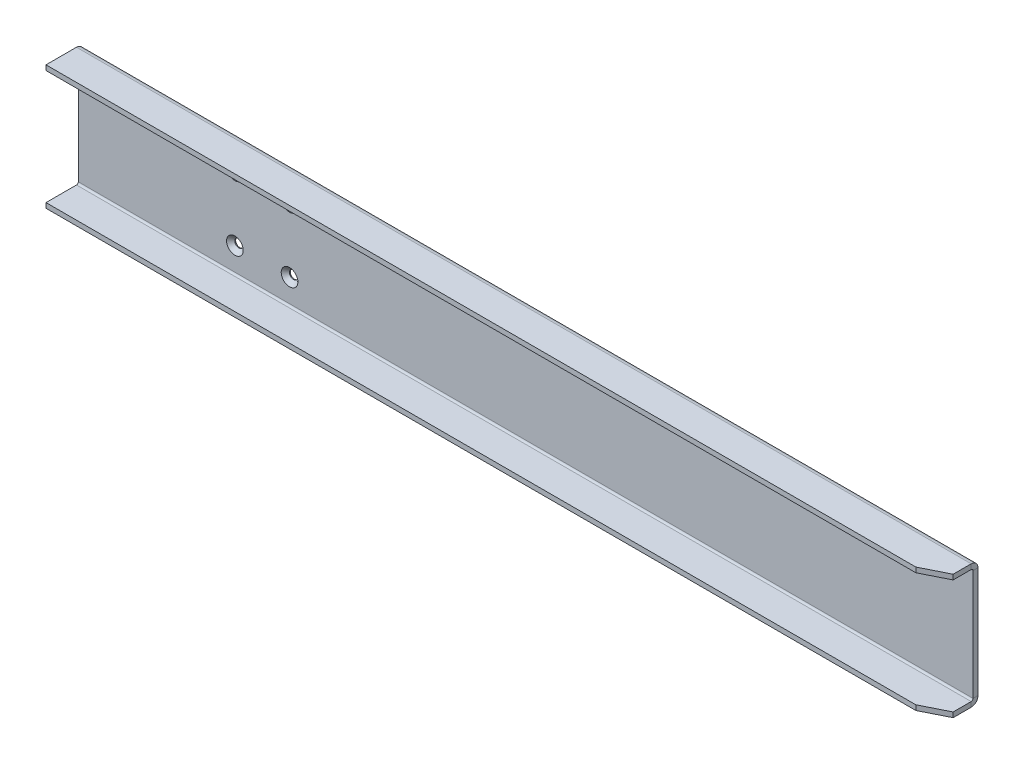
ISO-10303-21;
HEADER;
FILE_DESCRIPTION(('STEP AP214'),'2;1');
FILE_NAME('part.step','',(''),(''),'','','');
FILE_SCHEMA(('AUTOMOTIVE_DESIGN { 1 0 10303 214 1 1 1 1 }'));
ENDSEC;
DATA;
#1=APPLICATION_CONTEXT('core data for automotive mechanical design processes');
#2=APPLICATION_PROTOCOL_DEFINITION('international standard','automotive_design',2000,#1);
#3=PRODUCT_CONTEXT('',#1,'mechanical');
#4=PRODUCT('Part','Part','',(#3));
#5=PRODUCT_RELATED_PRODUCT_CATEGORY('part','',(#4));
#6=PRODUCT_DEFINITION_FORMATION('','',#4);
#7=PRODUCT_DEFINITION_CONTEXT('part definition',#1,'design');
#8=PRODUCT_DEFINITION('design','',#6,#7);
#9=PRODUCT_DEFINITION_SHAPE('','',#8);
#10=(LENGTH_UNIT() NAMED_UNIT(*) SI_UNIT(.MILLI.,.METRE.));
#11=(NAMED_UNIT(*) PLANE_ANGLE_UNIT() SI_UNIT($,.RADIAN.));
#12=(NAMED_UNIT(*) SI_UNIT($,.STERADIAN.) SOLID_ANGLE_UNIT());
#13=UNCERTAINTY_MEASURE_WITH_UNIT(LENGTH_MEASURE(1.E-05),#10,'distance_accuracy_value','');
#14=(GEOMETRIC_REPRESENTATION_CONTEXT(3) GLOBAL_UNCERTAINTY_ASSIGNED_CONTEXT((#13)) GLOBAL_UNIT_ASSIGNED_CONTEXT((#10,
#11,#12)) REPRESENTATION_CONTEXT('',''));
#15=CARTESIAN_POINT('',(0.,0.,0.));
#16=DIRECTION('',(0.,0.,1.));
#17=DIRECTION('',(1.,0.,0.));
#18=AXIS2_PLACEMENT_3D('',#15,#16,#17);
#19=CARTESIAN_POINT('',(0.,0.,-2.));
#20=DIRECTION('',(0.,0.,1.));
#21=DIRECTION('',(1.,0.,0.));
#22=AXIS2_PLACEMENT_3D('',#19,#20,#21);
#23=PLANE('',#22);
#24=CARTESIAN_POINT('',(628.127728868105,-1.21995043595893,-2.));
#25=DIRECTION('',(0.,0.,1.));
#26=DIRECTION('',(1.,0.,0.));
#27=AXIS2_PLACEMENT_3D('',#24,#25,#26);
#28=CIRCLE('',#27,1.70000000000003);
#29=CARTESIAN_POINT('',(629.827728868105,-1.21995043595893,-2.));
#30=VERTEX_POINT('',#29);
#31=EDGE_CURVE('E623',#30,#30,#28,.T.);
#32=ORIENTED_EDGE('',*,*,#31,.T.);
#33=EDGE_LOOP('',(#32));
#34=FACE_BOUND('',#33,.T.);
#35=CARTESIAN_POINT('',(628.127728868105,-27.2199504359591,-2.));
#36=DIRECTION('',(0.,0.,1.));
#37=DIRECTION('',(1.,0.,0.));
#38=AXIS2_PLACEMENT_3D('',#35,#36,#37);
#39=CIRCLE('',#38,1.70000000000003);
#40=CARTESIAN_POINT('',(629.827728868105,-27.2199504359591,-2.));
#41=VERTEX_POINT('',#40);
#42=EDGE_CURVE('E633',#41,#41,#39,.T.);
#43=ORIENTED_EDGE('',*,*,#42,.T.);
#44=EDGE_LOOP('',(#43));
#45=FACE_BOUND('',#44,.T.);
#46=CARTESIAN_POINT('',(650.127728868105,-27.2199504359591,-2.));
#47=DIRECTION('',(0.,0.,1.));
#48=DIRECTION('',(1.,0.,0.));
#49=AXIS2_PLACEMENT_3D('',#46,#47,#48);
#50=CIRCLE('',#49,1.70000000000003);
#51=CARTESIAN_POINT('',(651.827728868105,-27.2199504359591,-2.));
#52=VERTEX_POINT('',#51);
#53=EDGE_CURVE('E642',#52,#52,#50,.T.);
#54=ORIENTED_EDGE('',*,*,#53,.T.);
#55=EDGE_LOOP('',(#54));
#56=FACE_BOUND('',#55,.T.);
#57=CARTESIAN_POINT('',(650.127728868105,-1.21995043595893,-2.));
#58=DIRECTION('',(0.,0.,1.));
#59=DIRECTION('',(1.,0.,0.));
#60=AXIS2_PLACEMENT_3D('',#57,#58,#59);
#61=CIRCLE('',#60,1.70000000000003);
#62=CARTESIAN_POINT('',(651.827728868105,-1.21995043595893,-2.));
#63=VERTEX_POINT('',#62);
#64=EDGE_CURVE('E154',#63,#63,#61,.T.);
#65=ORIENTED_EDGE('',*,*,#64,.T.);
#66=EDGE_LOOP('',(#65));
#67=FACE_BOUND('',#66,.T.);
#68=DIRECTION('',(-1.,0.,0.));
#69=VECTOR('',#68,1.);
#70=CARTESIAN_POINT('',(565.127728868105,8.04344956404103,-2.));
#71=LINE('',#70,#69);
#72=CARTESIAN_POINT('',(565.127728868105,8.04344956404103,-2.));
#73=VERTEX_POINT('',#72);
#74=CARTESIAN_POINT('',(925.127728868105,8.04344956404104,-2.));
#75=VERTEX_POINT('',#74);
#76=EDGE_CURVE('E155',#73,#75,#71,.F.);
#77=ORIENTED_EDGE('',*,*,#76,.T.);
#78=DIRECTION('',(0.,1.,0.));
#79=VECTOR('',#78,1.);
#80=CARTESIAN_POINT('',(925.127728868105,10.780049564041,-2.));
#81=LINE('',#80,#79);
#82=CARTESIAN_POINT('',(925.127728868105,-36.483350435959,-2.));
#83=VERTEX_POINT('',#82);
#84=EDGE_CURVE('E233',#83,#75,#81,.T.);
#85=ORIENTED_EDGE('',*,*,#84,.F.);
#86=DIRECTION('',(1.,0.,0.));
#87=VECTOR('',#86,1.);
#88=CARTESIAN_POINT('',(925.127728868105,-36.483350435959,-2.));
#89=LINE('',#88,#87);
#90=CARTESIAN_POINT('',(565.127728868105,-36.483350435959,-2.));
#91=VERTEX_POINT('',#90);
#92=EDGE_CURVE('E207',#83,#91,#89,.F.);
#93=ORIENTED_EDGE('',*,*,#92,.T.);
#94=DIRECTION('',(0.,-1.,0.));
#95=VECTOR('',#94,1.);
#96=CARTESIAN_POINT('',(565.127728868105,10.780049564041,-2.));
#97=LINE('',#96,#95);
#98=EDGE_CURVE('E231',#73,#91,#97,.T.);
#99=ORIENTED_EDGE('',*,*,#98,.F.);
#100=EDGE_LOOP('',(#77,#85,#93,#99));
#101=FACE_BOUND('',#100,.T.);
#102=ADVANCED_FACE('F16',(#34,#45,#56,#67,#101),#23,.F.);
#103=CARTESIAN_POINT('',(0.,0.,0.));
#104=DIRECTION('',(0.,0.,1.));
#105=DIRECTION('',(1.,0.,0.));
#106=AXIS2_PLACEMENT_3D('',#103,#104,#105);
#107=PLANE('',#106);
#108=CARTESIAN_POINT('',(628.127728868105,-1.21995043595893,0.));
#109=DIRECTION('',(0.,0.,1.));
#110=DIRECTION('',(1.,0.,0.));
#111=AXIS2_PLACEMENT_3D('',#108,#109,#110);
#112=CIRCLE('',#111,3.36);
#113=CARTESIAN_POINT('',(631.487728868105,-1.21995043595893,0.));
#114=VERTEX_POINT('',#113);
#115=EDGE_CURVE('E621',#114,#114,#112,.T.);
#116=ORIENTED_EDGE('',*,*,#115,.F.);
#117=EDGE_LOOP('',(#116));
#118=FACE_BOUND('',#117,.T.);
#119=CARTESIAN_POINT('',(628.127728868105,-27.2199504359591,0.));
#120=DIRECTION('',(0.,0.,1.));
#121=DIRECTION('',(1.,0.,0.));
#122=AXIS2_PLACEMENT_3D('',#119,#120,#121);
#123=CIRCLE('',#122,3.36);
#124=CARTESIAN_POINT('',(631.487728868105,-27.2199504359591,0.));
#125=VERTEX_POINT('',#124);
#126=EDGE_CURVE('E627',#125,#125,#123,.T.);
#127=ORIENTED_EDGE('',*,*,#126,.F.);
#128=EDGE_LOOP('',(#127));
#129=FACE_BOUND('',#128,.T.);
#130=CARTESIAN_POINT('',(650.127728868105,-27.2199504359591,0.));
#131=DIRECTION('',(0.,0.,1.));
#132=DIRECTION('',(1.,0.,0.));
#133=AXIS2_PLACEMENT_3D('',#130,#131,#132);
#134=CIRCLE('',#133,3.36);
#135=CARTESIAN_POINT('',(653.487728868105,-27.2199504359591,0.));
#136=VERTEX_POINT('',#135);
#137=EDGE_CURVE('E636',#136,#136,#134,.T.);
#138=ORIENTED_EDGE('',*,*,#137,.F.);
#139=EDGE_LOOP('',(#138));
#140=FACE_BOUND('',#139,.T.);
#141=CARTESIAN_POINT('',(650.127728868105,-1.21995043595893,0.));
#142=DIRECTION('',(0.,0.,1.));
#143=DIRECTION('',(1.,0.,0.));
#144=AXIS2_PLACEMENT_3D('',#141,#142,#143);
#145=CIRCLE('',#144,3.36);
#146=CARTESIAN_POINT('',(653.487728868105,-1.21995043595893,0.));
#147=VERTEX_POINT('',#146);
#148=EDGE_CURVE('E645',#147,#147,#145,.T.);
#149=ORIENTED_EDGE('',*,*,#148,.F.);
#150=EDGE_LOOP('',(#149));
#151=FACE_BOUND('',#150,.T.);
#152=DIRECTION('',(0.,1.,0.));
#153=VECTOR('',#152,1.);
#154=CARTESIAN_POINT('',(925.127728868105,10.780049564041,0.));
#155=LINE('',#154,#153);
#156=CARTESIAN_POINT('',(925.127728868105,-36.483350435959,0.));
#157=VERTEX_POINT('',#156);
#158=CARTESIAN_POINT('',(925.127728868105,8.04344956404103,0.));
#159=VERTEX_POINT('',#158);
#160=EDGE_CURVE('E234',#157,#159,#155,.T.);
#161=ORIENTED_EDGE('',*,*,#160,.T.);
#162=DIRECTION('',(-1.,0.,0.));
#163=VECTOR('',#162,1.);
#164=CARTESIAN_POINT('',(565.127728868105,8.04344956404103,0.));
#165=LINE('',#164,#163);
#166=CARTESIAN_POINT('',(565.127728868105,8.04344956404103,0.));
#167=VERTEX_POINT('',#166);
#168=EDGE_CURVE('E167',#167,#159,#165,.F.);
#169=ORIENTED_EDGE('',*,*,#168,.F.);
#170=DIRECTION('',(0.,-1.,0.));
#171=VECTOR('',#170,1.);
#172=CARTESIAN_POINT('',(565.127728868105,10.780049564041,0.));
#173=LINE('',#172,#171);
#174=CARTESIAN_POINT('',(565.127728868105,-36.483350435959,0.));
#175=VERTEX_POINT('',#174);
#176=EDGE_CURVE('E228',#167,#175,#173,.T.);
#177=ORIENTED_EDGE('',*,*,#176,.T.);
#178=DIRECTION('',(1.,0.,0.));
#179=VECTOR('',#178,1.);
#180=CARTESIAN_POINT('',(925.127728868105,-36.483350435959,0.));
#181=LINE('',#180,#179);
#182=EDGE_CURVE('E220',#157,#175,#181,.F.);
#183=ORIENTED_EDGE('',*,*,#182,.F.);
#184=EDGE_LOOP('',(#161,#169,#177,#183));
#185=FACE_BOUND('',#184,.T.);
#186=ADVANCED_FACE('F298',(#118,#129,#140,#151,#185),#107,.T.);
#187=CARTESIAN_POINT('',(565.127728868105,10.780049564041,-2.));
#188=DIRECTION('',(-1.,0.,0.));
#189=DIRECTION('',(0.,0.,1.));
#190=AXIS2_PLACEMENT_3D('',#187,#188,#189);
#191=PLANE('',#190);
#192=ORIENTED_EDGE('',*,*,#176,.F.);
#193=DIRECTION('',(0.,0.,-1.));
#194=VECTOR('',#193,1.);
#195=CARTESIAN_POINT('',(565.127728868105,8.04344956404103,0.));
#196=LINE('',#195,#194);
#197=EDGE_CURVE('E161',#167,#73,#196,.T.);
#198=ORIENTED_EDGE('',*,*,#197,.T.);
#199=ORIENTED_EDGE('',*,*,#98,.T.);
#200=DIRECTION('',(0.,0.,-1.));
#201=VECTOR('',#200,1.);
#202=CARTESIAN_POINT('',(565.127728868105,-36.483350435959,0.));
#203=LINE('',#202,#201);
#204=EDGE_CURVE('E225',#175,#91,#203,.T.);
#205=ORIENTED_EDGE('',*,*,#204,.F.);
#206=EDGE_LOOP('',(#192,#198,#199,#205));
#207=FACE_BOUND('',#206,.T.);
#208=ADVANCED_FACE('F270',(#207),#191,.T.);
#209=CARTESIAN_POINT('',(925.127728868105,10.780049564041,-2.));
#210=DIRECTION('',(1.,0.,0.));
#211=DIRECTION('',(0.,0.,-1.));
#212=AXIS2_PLACEMENT_3D('',#209,#210,#211);
#213=PLANE('',#212);
#214=DIRECTION('',(0.,0.,-1.));
#215=VECTOR('',#214,1.);
#216=CARTESIAN_POINT('',(925.127728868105,8.04344956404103,0.));
#217=LINE('',#216,#215);
#218=EDGE_CURVE('E172',#159,#75,#217,.T.);
#219=ORIENTED_EDGE('',*,*,#218,.F.);
#220=ORIENTED_EDGE('',*,*,#160,.F.);
#221=DIRECTION('',(0.,0.,-1.));
#222=VECTOR('',#221,1.);
#223=CARTESIAN_POINT('',(925.127728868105,-36.483350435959,0.));
#224=LINE('',#223,#222);
#225=EDGE_CURVE('E214',#157,#83,#224,.T.);
#226=ORIENTED_EDGE('',*,*,#225,.T.);
#227=ORIENTED_EDGE('',*,*,#84,.T.);
#228=EDGE_LOOP('',(#219,#220,#226,#227));
#229=FACE_BOUND('',#228,.T.);
#230=ADVANCED_FACE('F277',(#229),#213,.T.);
#231=CARTESIAN_POINT('',(565.127728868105,-36.483350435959,0.7366));
#232=DIRECTION('',(-1.,0.,0.));
#233=DIRECTION('',(0.,0.,1.));
#234=AXIS2_PLACEMENT_3D('',#231,#232,#233);
#235=PLANE('',#234);
#236=DIRECTION('',(0.,1.,0.));
#237=VECTOR('',#236,1.);
#238=CARTESIAN_POINT('',(565.127728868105,-39.219950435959,0.73659999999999));
#239=LINE('',#238,#237);
#240=CARTESIAN_POINT('',(565.127728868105,-37.219950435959,0.7366));
#241=VERTEX_POINT('',#240);
#242=CARTESIAN_POINT('',(565.127728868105,-39.219950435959,0.736599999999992));
#243=VERTEX_POINT('',#242);
#244=EDGE_CURVE('E175',#241,#243,#239,.F.);
#245=ORIENTED_EDGE('',*,*,#244,.F.);
#246=CARTESIAN_POINT('',(565.127728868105,-36.483350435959,0.7366));
#247=DIRECTION('',(1.,0.,0.));
#248=DIRECTION('',(0.,0.,-1.));
#249=AXIS2_PLACEMENT_3D('',#246,#247,#248);
#250=CIRCLE('',#249,0.7366);
#251=EDGE_CURVE('E217',#175,#241,#250,.F.);
#252=ORIENTED_EDGE('',*,*,#251,.F.);
#253=ORIENTED_EDGE('',*,*,#204,.T.);
#254=CARTESIAN_POINT('',(565.127728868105,-36.483350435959,0.7366));
#255=DIRECTION('',(1.,0.,0.));
#256=DIRECTION('',(0.,0.,-1.));
#257=AXIS2_PLACEMENT_3D('',#254,#255,#256);
#258=CIRCLE('',#257,2.7366);
#259=EDGE_CURVE('E210',#91,#243,#258,.F.);
#260=ORIENTED_EDGE('',*,*,#259,.T.);
#261=EDGE_LOOP('',(#245,#252,#253,#260));
#262=FACE_BOUND('',#261,.T.);
#263=ADVANCED_FACE('F316',(#262),#235,.T.);
#264=CARTESIAN_POINT('',(925.127728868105,-36.483350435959,0.736599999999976));
#265=DIRECTION('',(-1.,0.,0.));
#266=DIRECTION('',(0.,0.,1.));
#267=AXIS2_PLACEMENT_3D('',#264,#265,#266);
#268=PLANE('',#267);
#269=CARTESIAN_POINT('',(925.127728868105,-36.483350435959,0.736599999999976));
#270=DIRECTION('',(1.,0.,0.));
#271=DIRECTION('',(0.,0.,-1.));
#272=AXIS2_PLACEMENT_3D('',#269,#270,#271);
#273=CIRCLE('',#272,0.7366);
#274=CARTESIAN_POINT('',(925.127728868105,-37.219950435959,0.736599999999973));
#275=VERTEX_POINT('',#274);
#276=EDGE_CURVE('E181',#275,#157,#273,.T.);
#277=ORIENTED_EDGE('',*,*,#276,.F.);
#278=DIRECTION('',(0.,1.,0.));
#279=VECTOR('',#278,1.);
#280=CARTESIAN_POINT('',(925.127728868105,-37.219950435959,0.736599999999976));
#281=LINE('',#280,#279);
#282=CARTESIAN_POINT('',(925.127728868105,-39.219950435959,0.736599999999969));
#283=VERTEX_POINT('',#282);
#284=EDGE_CURVE('E200',#275,#283,#281,.F.);
#285=ORIENTED_EDGE('',*,*,#284,.T.);
#286=CARTESIAN_POINT('',(925.127728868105,-36.483350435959,0.736599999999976));
#287=DIRECTION('',(1.,0.,0.));
#288=DIRECTION('',(0.,0.,-1.));
#289=AXIS2_PLACEMENT_3D('',#286,#287,#288);
#290=CIRCLE('',#289,2.7366);
#291=EDGE_CURVE('E211',#283,#83,#290,.T.);
#292=ORIENTED_EDGE('',*,*,#291,.T.);
#293=ORIENTED_EDGE('',*,*,#225,.F.);
#294=EDGE_LOOP('',(#277,#285,#292,#293));
#295=FACE_BOUND('',#294,.T.);
#296=ADVANCED_FACE('F311',(#295),#268,.F.);
#297=CARTESIAN_POINT('',(925.127728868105,-36.483350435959,0.736599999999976));
#298=DIRECTION('',(1.,0.,0.));
#299=DIRECTION('',(0.,-1.,0.));
#300=AXIS2_PLACEMENT_3D('',#297,#298,#299);
#301=CYLINDRICAL_SURFACE('',#300,2.7366);
#302=ORIENTED_EDGE('',*,*,#92,.F.);
#303=ORIENTED_EDGE('',*,*,#291,.F.);
#304=DIRECTION('',(1.,0.,0.));
#305=VECTOR('',#304,1.);
#306=CARTESIAN_POINT('',(565.127728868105,-39.219950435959,0.73659999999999));
#307=LINE('',#306,#305);
#308=EDGE_CURVE('E198',#283,#243,#307,.F.);
#309=ORIENTED_EDGE('',*,*,#308,.T.);
#310=ORIENTED_EDGE('',*,*,#259,.F.);
#311=EDGE_LOOP('',(#302,#303,#309,#310));
#312=FACE_BOUND('',#311,.T.);
#313=ADVANCED_FACE('F355',(#312),#301,.T.);
#314=CARTESIAN_POINT('',(925.127728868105,-36.483350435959,0.736599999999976));
#315=DIRECTION('',(1.,0.,0.));
#316=DIRECTION('',(0.,-1.,0.));
#317=AXIS2_PLACEMENT_3D('',#314,#315,#316);
#318=CYLINDRICAL_SURFACE('',#317,0.7366);
#319=ORIENTED_EDGE('',*,*,#182,.T.);
#320=ORIENTED_EDGE('',*,*,#251,.T.);
#321=DIRECTION('',(1.,0.,0.));
#322=VECTOR('',#321,1.);
#323=CARTESIAN_POINT('',(565.127728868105,-37.219950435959,0.7366));
#324=LINE('',#323,#322);
#325=EDGE_CURVE('E203',#241,#275,#324,.T.);
#326=ORIENTED_EDGE('',*,*,#325,.T.);
#327=ORIENTED_EDGE('',*,*,#276,.T.);
#328=EDGE_LOOP('',(#319,#320,#326,#327));
#329=FACE_BOUND('',#328,.T.);
#330=ADVANCED_FACE('F352',(#329),#318,.F.);
#331=CARTESIAN_POINT('',(565.127728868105,-39.219950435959,0.));
#332=DIRECTION('',(1.,0.,0.));
#333=DIRECTION('',(0.,0.,-1.));
#334=AXIS2_PLACEMENT_3D('',#331,#332,#333);
#335=PLANE('',#334);
#336=ORIENTED_EDGE('',*,*,#244,.T.);
#337=DIRECTION('',(0.,0.,-1.));
#338=VECTOR('',#337,1.);
#339=CARTESIAN_POINT('',(565.127728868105,-39.219950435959,-1.46323942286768E-11));
#340=LINE('',#339,#338);
#341=CARTESIAN_POINT('',(565.127728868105,-39.219950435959,13.));
#342=VERTEX_POINT('',#341);
#343=EDGE_CURVE('E187',#342,#243,#340,.T.);
#344=ORIENTED_EDGE('',*,*,#343,.F.);
#345=DIRECTION('',(0.,1.,0.));
#346=VECTOR('',#345,1.);
#347=CARTESIAN_POINT('',(565.127728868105,-39.219950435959,13.));
#348=LINE('',#347,#346);
#349=CARTESIAN_POINT('',(565.127728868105,-37.219950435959,13.));
#350=VERTEX_POINT('',#349);
#351=EDGE_CURVE('E178',#342,#350,#348,.T.);
#352=ORIENTED_EDGE('',*,*,#351,.T.);
#353=DIRECTION('',(0.,0.,1.));
#354=VECTOR('',#353,1.);
#355=CARTESIAN_POINT('',(565.127728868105,-37.219950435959,0.));
#356=LINE('',#355,#354);
#357=EDGE_CURVE('E195',#350,#241,#356,.F.);
#358=ORIENTED_EDGE('',*,*,#357,.T.);
#359=EDGE_LOOP('',(#336,#344,#352,#358));
#360=FACE_BOUND('',#359,.T.);
#361=ADVANCED_FACE('F341',(#360),#335,.F.);
#362=CARTESIAN_POINT('',(925.127728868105,-39.219950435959,13.));
#363=DIRECTION('',(-1.,0.,0.));
#364=DIRECTION('',(0.,0.,1.));
#365=AXIS2_PLACEMENT_3D('',#362,#363,#364);
#366=PLANE('',#365);
#367=DIRECTION('',(0.,0.,-1.));
#368=VECTOR('',#367,1.);
#369=CARTESIAN_POINT('',(925.127728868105,-37.219950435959,13.));
#370=LINE('',#369,#368);
#371=CARTESIAN_POINT('',(925.127728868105,-37.219950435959,8.));
#372=VERTEX_POINT('',#371);
#373=EDGE_CURVE('E192',#275,#372,#370,.F.);
#374=ORIENTED_EDGE('',*,*,#373,.T.);
#375=DIRECTION('',(0.,-1.,0.));
#376=VECTOR('',#375,1.);
#377=CARTESIAN_POINT('',(925.127728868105,-39.219950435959,8.));
#378=LINE('',#377,#376);
#379=CARTESIAN_POINT('',(925.127728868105,-39.219950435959,8.));
#380=VERTEX_POINT('',#379);
#381=EDGE_CURVE('E245',#372,#380,#378,.T.);
#382=ORIENTED_EDGE('',*,*,#381,.T.);
#383=DIRECTION('',(0.,0.,1.));
#384=VECTOR('',#383,1.);
#385=CARTESIAN_POINT('',(925.127728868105,-39.219950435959,-1.53521541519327E-13));
#386=LINE('',#385,#384);
#387=EDGE_CURVE('E184',#283,#380,#386,.T.);
#388=ORIENTED_EDGE('',*,*,#387,.F.);
#389=ORIENTED_EDGE('',*,*,#284,.F.);
#390=EDGE_LOOP('',(#374,#382,#388,#389));
#391=FACE_BOUND('',#390,.T.);
#392=ADVANCED_FACE('F346',(#391),#366,.F.);
#393=CARTESIAN_POINT('',(0.,-39.219950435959,-1.53521541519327E-13));
#394=DIRECTION('',(0.,1.,0.));
#395=DIRECTION('',(0.,0.,1.));
#396=AXIS2_PLACEMENT_3D('',#393,#394,#395);
#397=PLANE('',#396);
#398=ORIENTED_EDGE('',*,*,#387,.T.);
#399=DIRECTION('',(0.894427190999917,0.,-0.447213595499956));
#400=VECTOR('',#399,1.);
#401=CARTESIAN_POINT('',(915.127728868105,-39.219950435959,13.));
#402=LINE('',#401,#400);
#403=CARTESIAN_POINT('',(915.127728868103,-39.219950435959,13.0000000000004));
#404=VERTEX_POINT('',#403);
#405=EDGE_CURVE('E247',#380,#404,#402,.F.);
#406=ORIENTED_EDGE('',*,*,#405,.T.);
#407=DIRECTION('',(-1.,0.,0.));
#408=VECTOR('',#407,1.);
#409=CARTESIAN_POINT('',(0.,-39.219950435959,13.));
#410=LINE('',#409,#408);
#411=EDGE_CURVE('E182',#404,#342,#410,.T.);
#412=ORIENTED_EDGE('',*,*,#411,.T.);
#413=ORIENTED_EDGE('',*,*,#343,.T.);
#414=ORIENTED_EDGE('',*,*,#308,.F.);
#415=EDGE_LOOP('',(#398,#406,#412,#413,#414));
#416=FACE_BOUND('',#415,.T.);
#417=ADVANCED_FACE('F333',(#416),#397,.F.);
#418=CARTESIAN_POINT('',(0.,-37.219950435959,-1.46538578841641E-13));
#419=DIRECTION('',(0.,1.,0.));
#420=DIRECTION('',(0.,0.,1.));
#421=AXIS2_PLACEMENT_3D('',#418,#419,#420);
#422=PLANE('',#421);
#423=DIRECTION('',(1.,0.,0.));
#424=VECTOR('',#423,1.);
#425=CARTESIAN_POINT('',(565.127728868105,-37.219950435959,13.));
#426=LINE('',#425,#424);
#427=CARTESIAN_POINT('',(915.127728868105,-37.219950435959,12.9999999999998));
#428=VERTEX_POINT('',#427);
#429=EDGE_CURVE('E190',#428,#350,#426,.F.);
#430=ORIENTED_EDGE('',*,*,#429,.F.);
#431=DIRECTION('',(-0.894427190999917,0.,0.447213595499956));
#432=VECTOR('',#431,1.);
#433=CARTESIAN_POINT('',(188.22554577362,-37.2199504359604,376.45109154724));
#434=LINE('',#433,#432);
#435=EDGE_CURVE('E243',#428,#372,#434,.F.);
#436=ORIENTED_EDGE('',*,*,#435,.T.);
#437=ORIENTED_EDGE('',*,*,#373,.F.);
#438=ORIENTED_EDGE('',*,*,#325,.F.);
#439=ORIENTED_EDGE('',*,*,#357,.F.);
#440=EDGE_LOOP('',(#430,#436,#437,#438,#439));
#441=FACE_BOUND('',#440,.T.);
#442=ADVANCED_FACE('F293',(#441),#422,.T.);
#443=CARTESIAN_POINT('',(565.127728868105,-39.219950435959,13.));
#444=DIRECTION('',(0.,0.,-1.));
#445=DIRECTION('',(0.,1.,0.));
#446=AXIS2_PLACEMENT_3D('',#443,#444,#445);
#447=PLANE('',#446);
#448=ORIENTED_EDGE('',*,*,#411,.F.);
#449=DIRECTION('',(0.,1.,0.));
#450=VECTOR('',#449,1.);
#451=CARTESIAN_POINT('',(915.127728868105,-39.219950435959,13.));
#452=LINE('',#451,#450);
#453=EDGE_CURVE('E237',#404,#428,#452,.T.);
#454=ORIENTED_EDGE('',*,*,#453,.T.);
#455=ORIENTED_EDGE('',*,*,#429,.T.);
#456=ORIENTED_EDGE('',*,*,#351,.F.);
#457=EDGE_LOOP('',(#448,#454,#455,#456));
#458=FACE_BOUND('',#457,.T.);
#459=ADVANCED_FACE('F284',(#458),#447,.F.);
#460=CARTESIAN_POINT('',(925.127728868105,8.04344956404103,0.7366));
#461=DIRECTION('',(1.,0.,0.));
#462=DIRECTION('',(0.,0.,-1.));
#463=AXIS2_PLACEMENT_3D('',#460,#461,#462);
#464=PLANE('',#463);
#465=DIRECTION('',(0.,-1.,0.));
#466=VECTOR('',#465,1.);
#467=CARTESIAN_POINT('',(925.127728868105,10.780049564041,0.73659999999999));
#468=LINE('',#467,#466);
#469=CARTESIAN_POINT('',(925.127728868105,8.78004956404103,0.7366));
#470=VERTEX_POINT('',#469);
#471=CARTESIAN_POINT('',(925.127728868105,10.780049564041,0.736599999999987));
#472=VERTEX_POINT('',#471);
#473=EDGE_CURVE('E151',#470,#472,#468,.F.);
#474=ORIENTED_EDGE('',*,*,#473,.F.);
#475=CARTESIAN_POINT('',(925.127728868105,8.04344956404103,0.7366));
#476=DIRECTION('',(-1.,0.,0.));
#477=DIRECTION('',(0.,0.,1.));
#478=AXIS2_PLACEMENT_3D('',#475,#476,#477);
#479=CIRCLE('',#478,0.7366);
#480=EDGE_CURVE('E164',#159,#470,#479,.F.);
#481=ORIENTED_EDGE('',*,*,#480,.F.);
#482=ORIENTED_EDGE('',*,*,#218,.T.);
#483=CARTESIAN_POINT('',(925.127728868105,8.04344956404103,0.7366));
#484=DIRECTION('',(-1.,0.,0.));
#485=DIRECTION('',(0.,0.,1.));
#486=AXIS2_PLACEMENT_3D('',#483,#484,#485);
#487=CIRCLE('',#486,2.7366);
#488=EDGE_CURVE('E157',#75,#472,#487,.F.);
#489=ORIENTED_EDGE('',*,*,#488,.T.);
#490=EDGE_LOOP('',(#474,#481,#482,#489));
#491=FACE_BOUND('',#490,.T.);
#492=ADVANCED_FACE('F282',(#491),#464,.T.);
#493=CARTESIAN_POINT('',(565.127728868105,8.04344956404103,0.736600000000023));
#494=DIRECTION('',(1.,0.,0.));
#495=DIRECTION('',(0.,0.,-1.));
#496=AXIS2_PLACEMENT_3D('',#493,#494,#495);
#497=PLANE('',#496);
#498=CARTESIAN_POINT('',(565.127728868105,8.04344956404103,0.736600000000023));
#499=DIRECTION('',(-1.,0.,0.));
#500=DIRECTION('',(0.,0.,1.));
#501=AXIS2_PLACEMENT_3D('',#498,#499,#500);
#502=CIRCLE('',#501,0.7366);
#503=CARTESIAN_POINT('',(565.127728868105,8.78004956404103,0.736600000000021));
#504=VERTEX_POINT('',#503);
#505=EDGE_CURVE('E133',#504,#167,#502,.T.);
#506=ORIENTED_EDGE('',*,*,#505,.F.);
#507=DIRECTION('',(0.,-1.,0.));
#508=VECTOR('',#507,1.);
#509=CARTESIAN_POINT('',(565.127728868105,8.78004956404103,0.736600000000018));
#510=LINE('',#509,#508);
#511=CARTESIAN_POINT('',(565.127728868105,10.780049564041,0.736600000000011));
#512=VERTEX_POINT('',#511);
#513=EDGE_CURVE('E146',#504,#512,#510,.F.);
#514=ORIENTED_EDGE('',*,*,#513,.T.);
#515=CARTESIAN_POINT('',(565.127728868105,8.04344956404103,0.736600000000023));
#516=DIRECTION('',(-1.,0.,0.));
#517=DIRECTION('',(0.,0.,1.));
#518=AXIS2_PLACEMENT_3D('',#515,#516,#517);
#519=CIRCLE('',#518,2.7366);
#520=EDGE_CURVE('E158',#512,#73,#519,.T.);
#521=ORIENTED_EDGE('',*,*,#520,.T.);
#522=ORIENTED_EDGE('',*,*,#197,.F.);
#523=EDGE_LOOP('',(#506,#514,#521,#522));
#524=FACE_BOUND('',#523,.T.);
#525=ADVANCED_FACE('F266',(#524),#497,.F.);
#526=CARTESIAN_POINT('',(565.127728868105,8.04344956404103,0.736600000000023));
#527=DIRECTION('',(-1.,0.,0.));
#528=DIRECTION('',(0.,1.,0.));
#529=AXIS2_PLACEMENT_3D('',#526,#527,#528);
#530=CYLINDRICAL_SURFACE('',#529,2.7366);
#531=ORIENTED_EDGE('',*,*,#76,.F.);
#532=ORIENTED_EDGE('',*,*,#520,.F.);
#533=DIRECTION('',(-1.,0.,0.));
#534=VECTOR('',#533,1.);
#535=CARTESIAN_POINT('',(925.127728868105,10.780049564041,0.73659999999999));
#536=LINE('',#535,#534);
#537=EDGE_CURVE('E123',#512,#472,#536,.F.);
#538=ORIENTED_EDGE('',*,*,#537,.T.);
#539=ORIENTED_EDGE('',*,*,#488,.F.);
#540=EDGE_LOOP('',(#531,#532,#538,#539));
#541=FACE_BOUND('',#540,.T.);
#542=ADVANCED_FACE('F274',(#541),#530,.T.);
#543=CARTESIAN_POINT('',(565.127728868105,8.04344956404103,0.736600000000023));
#544=DIRECTION('',(-1.,0.,0.));
#545=DIRECTION('',(0.,1.,0.));
#546=AXIS2_PLACEMENT_3D('',#543,#544,#545);
#547=CYLINDRICAL_SURFACE('',#546,0.7366);
#548=ORIENTED_EDGE('',*,*,#168,.T.);
#549=ORIENTED_EDGE('',*,*,#480,.T.);
#550=DIRECTION('',(-1.,0.,0.));
#551=VECTOR('',#550,1.);
#552=CARTESIAN_POINT('',(925.127728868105,8.78004956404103,0.7366));
#553=LINE('',#552,#551);
#554=EDGE_CURVE('E149',#470,#504,#553,.T.);
#555=ORIENTED_EDGE('',*,*,#554,.T.);
#556=ORIENTED_EDGE('',*,*,#505,.T.);
#557=EDGE_LOOP('',(#548,#549,#555,#556));
#558=FACE_BOUND('',#557,.T.);
#559=ADVANCED_FACE('F262',(#558),#547,.F.);
#560=CARTESIAN_POINT('',(925.127728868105,10.780049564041,0.));
#561=DIRECTION('',(-1.,0.,0.));
#562=DIRECTION('',(0.,0.,1.));
#563=AXIS2_PLACEMENT_3D('',#560,#561,#562);
#564=PLANE('',#563);
#565=DIRECTION('',(0.,0.,-1.));
#566=VECTOR('',#565,1.);
#567=CARTESIAN_POINT('',(925.127728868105,10.780049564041,0.));
#568=LINE('',#567,#566);
#569=CARTESIAN_POINT('',(925.127728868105,10.780049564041,8.));
#570=VERTEX_POINT('',#569);
#571=EDGE_CURVE('E126',#570,#472,#568,.T.);
#572=ORIENTED_EDGE('',*,*,#571,.F.);
#573=DIRECTION('',(0.,-1.,0.));
#574=VECTOR('',#573,1.);
#575=CARTESIAN_POINT('',(925.127728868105,10.780049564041,8.));
#576=LINE('',#575,#574);
#577=CARTESIAN_POINT('',(925.127728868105,8.78004956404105,7.99999999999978));
#578=VERTEX_POINT('',#577);
#579=EDGE_CURVE('E249',#570,#578,#576,.T.);
#580=ORIENTED_EDGE('',*,*,#579,.T.);
#581=DIRECTION('',(0.,0.,1.));
#582=VECTOR('',#581,1.);
#583=CARTESIAN_POINT('',(925.127728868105,8.78004956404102,0.));
#584=LINE('',#583,#582);
#585=EDGE_CURVE('E143',#578,#470,#584,.F.);
#586=ORIENTED_EDGE('',*,*,#585,.T.);
#587=ORIENTED_EDGE('',*,*,#473,.T.);
#588=EDGE_LOOP('',(#572,#580,#586,#587));
#589=FACE_BOUND('',#588,.T.);
#590=ADVANCED_FACE('F255',(#589),#564,.F.);
#591=CARTESIAN_POINT('',(565.127728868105,10.7800495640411,13.));
#592=DIRECTION('',(1.,0.,0.));
#593=DIRECTION('',(0.,0.,-1.));
#594=AXIS2_PLACEMENT_3D('',#591,#592,#593);
#595=PLANE('',#594);
#596=ORIENTED_EDGE('',*,*,#513,.F.);
#597=DIRECTION('',(0.,0.,-1.));
#598=VECTOR('',#597,1.);
#599=CARTESIAN_POINT('',(565.127728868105,8.78004956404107,13.));
#600=LINE('',#599,#598);
#601=CARTESIAN_POINT('',(565.127728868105,8.78004956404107,13.));
#602=VERTEX_POINT('',#601);
#603=EDGE_CURVE('E132',#504,#602,#600,.F.);
#604=ORIENTED_EDGE('',*,*,#603,.T.);
#605=DIRECTION('',(0.,-1.,0.));
#606=VECTOR('',#605,1.);
#607=CARTESIAN_POINT('',(565.127728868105,10.7800495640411,13.));
#608=LINE('',#607,#606);
#609=CARTESIAN_POINT('',(565.127728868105,10.7800495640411,13.));
#610=VERTEX_POINT('',#609);
#611=EDGE_CURVE('E129',#610,#602,#608,.T.);
#612=ORIENTED_EDGE('',*,*,#611,.F.);
#613=DIRECTION('',(0.,0.,1.));
#614=VECTOR('',#613,1.);
#615=CARTESIAN_POINT('',(565.127728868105,10.780049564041,-1.45232564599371E-11));
#616=LINE('',#615,#614);
#617=EDGE_CURVE('E117',#512,#610,#616,.T.);
#618=ORIENTED_EDGE('',*,*,#617,.F.);
#619=EDGE_LOOP('',(#596,#604,#612,#618));
#620=FACE_BOUND('',#619,.T.);
#621=ADVANCED_FACE('F130',(#620),#595,.F.);
#622=CARTESIAN_POINT('',(0.,10.780049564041,0.));
#623=DIRECTION('',(0.,-1.,0.));
#624=DIRECTION('',(0.,0.,-1.));
#625=AXIS2_PLACEMENT_3D('',#622,#623,#624);
#626=PLANE('',#625);
#627=DIRECTION('',(1.,0.,0.));
#628=VECTOR('',#627,1.);
#629=CARTESIAN_POINT('',(0.,10.7800495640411,13.));
#630=LINE('',#629,#628);
#631=CARTESIAN_POINT('',(915.127728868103,10.7800495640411,13.0000000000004));
#632=VERTEX_POINT('',#631);
#633=EDGE_CURVE('E120',#610,#632,#630,.T.);
#634=ORIENTED_EDGE('',*,*,#633,.T.);
#635=DIRECTION('',(-0.894427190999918,0.,0.447213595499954));
#636=VECTOR('',#635,1.);
#637=CARTESIAN_POINT('',(925.127728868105,10.780049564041,8.));
#638=LINE('',#637,#636);
#639=EDGE_CURVE('E11',#632,#570,#638,.F.);
#640=ORIENTED_EDGE('',*,*,#639,.T.);
#641=ORIENTED_EDGE('',*,*,#571,.T.);
#642=ORIENTED_EDGE('',*,*,#537,.F.);
#643=ORIENTED_EDGE('',*,*,#617,.T.);
#644=EDGE_LOOP('',(#634,#640,#641,#642,#643));
#645=FACE_BOUND('',#644,.T.);
#646=ADVANCED_FACE('F119',(#645),#626,.F.);
#647=CARTESIAN_POINT('',(0.,8.78004956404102,0.));
#648=DIRECTION('',(0.,-1.,0.));
#649=DIRECTION('',(0.,0.,-1.));
#650=AXIS2_PLACEMENT_3D('',#647,#648,#649);
#651=PLANE('',#650);
#652=ORIENTED_EDGE('',*,*,#585,.F.);
#653=DIRECTION('',(0.894427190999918,0.,-0.447213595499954));
#654=VECTOR('',#653,1.);
#655=CARTESIAN_POINT('',(188.225545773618,8.78004956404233,376.45109154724));
#656=LINE('',#655,#654);
#657=CARTESIAN_POINT('',(915.127728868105,8.78004956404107,13.));
#658=VERTEX_POINT('',#657);
#659=EDGE_CURVE('E38',#578,#658,#656,.F.);
#660=ORIENTED_EDGE('',*,*,#659,.T.);
#661=DIRECTION('',(-1.,0.,0.));
#662=VECTOR('',#661,1.);
#663=CARTESIAN_POINT('',(925.127728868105,8.78004956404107,13.));
#664=LINE('',#663,#662);
#665=EDGE_CURVE('E140',#602,#658,#664,.F.);
#666=ORIENTED_EDGE('',*,*,#665,.F.);
#667=ORIENTED_EDGE('',*,*,#603,.F.);
#668=ORIENTED_EDGE('',*,*,#554,.F.);
#669=EDGE_LOOP('',(#652,#660,#666,#667,#668));
#670=FACE_BOUND('',#669,.T.);
#671=ADVANCED_FACE('F259',(#670),#651,.T.);
#672=CARTESIAN_POINT('',(925.127728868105,10.7800495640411,13.));
#673=DIRECTION('',(0.,0.,-1.));
#674=DIRECTION('',(0.,1.,0.));
#675=AXIS2_PLACEMENT_3D('',#672,#673,#674);
#676=PLANE('',#675);
#677=ORIENTED_EDGE('',*,*,#665,.T.);
#678=DIRECTION('',(0.,1.,0.));
#679=VECTOR('',#678,1.);
#680=CARTESIAN_POINT('',(915.127728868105,10.7800495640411,13.));
#681=LINE('',#680,#679);
#682=EDGE_CURVE('E24',#658,#632,#681,.T.);
#683=ORIENTED_EDGE('',*,*,#682,.T.);
#684=ORIENTED_EDGE('',*,*,#633,.F.);
#685=ORIENTED_EDGE('',*,*,#611,.T.);
#686=EDGE_LOOP('',(#677,#683,#684,#685));
#687=FACE_BOUND('',#686,.T.);
#688=ADVANCED_FACE('F135',(#687),#676,.F.);
#689=CARTESIAN_POINT('',(915.127728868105,-39.219950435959,13.));
#690=DIRECTION('',(-0.447213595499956,0.,-0.894427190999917));
#691=DIRECTION('',(0.,1.,0.));
#692=AXIS2_PLACEMENT_3D('',#689,#690,#691);
#693=PLANE('',#692);
#694=ORIENTED_EDGE('',*,*,#405,.F.);
#695=ORIENTED_EDGE('',*,*,#381,.F.);
#696=ORIENTED_EDGE('',*,*,#435,.F.);
#697=ORIENTED_EDGE('',*,*,#453,.F.);
#698=EDGE_LOOP('',(#694,#695,#696,#697));
#699=FACE_BOUND('',#698,.T.);
#700=ADVANCED_FACE('F318',(#699),#693,.F.);
#701=CARTESIAN_POINT('',(925.127728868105,10.780049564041,8.));
#702=DIRECTION('',(-0.447213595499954,0.,-0.894427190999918));
#703=DIRECTION('',(0.,-1.,0.));
#704=AXIS2_PLACEMENT_3D('',#701,#702,#703);
#705=PLANE('',#704);
#706=ORIENTED_EDGE('',*,*,#639,.F.);
#707=ORIENTED_EDGE('',*,*,#682,.F.);
#708=ORIENTED_EDGE('',*,*,#659,.F.);
#709=ORIENTED_EDGE('',*,*,#579,.F.);
#710=EDGE_LOOP('',(#706,#707,#708,#709));
#711=FACE_BOUND('',#710,.T.);
#712=ADVANCED_FACE('F18',(#711),#705,.F.);
#713=CARTESIAN_POINT('',(650.127728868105,-1.21995043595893,0.));
#714=DIRECTION('',(0.,0.,1.));
#715=DIRECTION('',(1.,0.,0.));
#716=AXIS2_PLACEMENT_3D('',#713,#714,#715);
#717=CYLINDRICAL_SURFACE('',#716,1.70000000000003);
#718=ORIENTED_EDGE('',*,*,#64,.F.);
#719=EDGE_LOOP('',(#718));
#720=FACE_BOUND('',#719,.T.);
#721=CARTESIAN_POINT('',(650.127728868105,-1.21995043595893,-1.66));
#722=DIRECTION('',(0.,0.,1.));
#723=DIRECTION('',(1.,0.,0.));
#724=AXIS2_PLACEMENT_3D('',#721,#722,#723);
#725=CIRCLE('',#724,1.70000000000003);
#726=CARTESIAN_POINT('',(651.827728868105,-1.21995043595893,-1.66));
#727=VERTEX_POINT('',#726);
#728=EDGE_CURVE('E648',#727,#727,#725,.T.);
#729=ORIENTED_EDGE('',*,*,#728,.T.);
#730=EDGE_LOOP('',(#729));
#731=FACE_BOUND('',#730,.T.);
#732=ADVANCED_FACE('F326',(#720,#731),#717,.F.);
#733=CARTESIAN_POINT('',(650.127728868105,-1.21995043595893,0.));
#734=DIRECTION('',(0.,0.,1.));
#735=DIRECTION('',(1.,0.,0.));
#736=AXIS2_PLACEMENT_3D('',#733,#734,#735);
#737=CONICAL_SURFACE('',#736,3.36,0.785398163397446);
#738=ORIENTED_EDGE('',*,*,#728,.F.);
#739=EDGE_LOOP('',(#738));
#740=FACE_BOUND('',#739,.T.);
#741=ORIENTED_EDGE('',*,*,#148,.T.);
#742=EDGE_LOOP('',(#741));
#743=FACE_BOUND('',#742,.T.);
#744=ADVANCED_FACE('F475',(#740,#743),#737,.F.);
#745=CARTESIAN_POINT('',(650.127728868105,-27.2199504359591,0.));
#746=DIRECTION('',(0.,0.,1.));
#747=DIRECTION('',(1.,0.,0.));
#748=AXIS2_PLACEMENT_3D('',#745,#746,#747);
#749=CYLINDRICAL_SURFACE('',#748,1.70000000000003);
#750=ORIENTED_EDGE('',*,*,#53,.F.);
#751=EDGE_LOOP('',(#750));
#752=FACE_BOUND('',#751,.T.);
#753=CARTESIAN_POINT('',(650.127728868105,-27.2199504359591,-1.66));
#754=DIRECTION('',(0.,0.,1.));
#755=DIRECTION('',(1.,0.,0.));
#756=AXIS2_PLACEMENT_3D('',#753,#754,#755);
#757=CIRCLE('',#756,1.70000000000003);
#758=CARTESIAN_POINT('',(651.827728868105,-27.2199504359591,-1.66));
#759=VERTEX_POINT('',#758);
#760=EDGE_CURVE('E639',#759,#759,#757,.T.);
#761=ORIENTED_EDGE('',*,*,#760,.T.);
#762=EDGE_LOOP('',(#761));
#763=FACE_BOUND('',#762,.T.);
#764=ADVANCED_FACE('F485',(#752,#763),#749,.F.);
#765=CARTESIAN_POINT('',(650.127728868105,-27.2199504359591,0.));
#766=DIRECTION('',(0.,0.,1.));
#767=DIRECTION('',(1.,0.,0.));
#768=AXIS2_PLACEMENT_3D('',#765,#766,#767);
#769=CONICAL_SURFACE('',#768,3.36,0.785398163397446);
#770=ORIENTED_EDGE('',*,*,#760,.F.);
#771=EDGE_LOOP('',(#770));
#772=FACE_BOUND('',#771,.T.);
#773=ORIENTED_EDGE('',*,*,#137,.T.);
#774=EDGE_LOOP('',(#773));
#775=FACE_BOUND('',#774,.T.);
#776=ADVANCED_FACE('F496',(#772,#775),#769,.F.);
#777=CARTESIAN_POINT('',(628.127728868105,-27.2199504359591,0.));
#778=DIRECTION('',(0.,0.,1.));
#779=DIRECTION('',(1.,0.,0.));
#780=AXIS2_PLACEMENT_3D('',#777,#778,#779);
#781=CYLINDRICAL_SURFACE('',#780,1.70000000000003);
#782=ORIENTED_EDGE('',*,*,#42,.F.);
#783=EDGE_LOOP('',(#782));
#784=FACE_BOUND('',#783,.T.);
#785=CARTESIAN_POINT('',(628.127728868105,-27.2199504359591,-1.66));
#786=DIRECTION('',(0.,0.,1.));
#787=DIRECTION('',(1.,0.,0.));
#788=AXIS2_PLACEMENT_3D('',#785,#786,#787);
#789=CIRCLE('',#788,1.70000000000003);
#790=CARTESIAN_POINT('',(629.827728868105,-27.2199504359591,-1.66));
#791=VERTEX_POINT('',#790);
#792=EDGE_CURVE('E630',#791,#791,#789,.T.);
#793=ORIENTED_EDGE('',*,*,#792,.T.);
#794=EDGE_LOOP('',(#793));
#795=FACE_BOUND('',#794,.T.);
#796=ADVANCED_FACE('F506',(#784,#795),#781,.F.);
#797=CARTESIAN_POINT('',(628.127728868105,-27.2199504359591,0.));
#798=DIRECTION('',(0.,0.,1.));
#799=DIRECTION('',(1.,0.,0.));
#800=AXIS2_PLACEMENT_3D('',#797,#798,#799);
#801=CONICAL_SURFACE('',#800,3.36,0.785398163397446);
#802=ORIENTED_EDGE('',*,*,#792,.F.);
#803=EDGE_LOOP('',(#802));
#804=FACE_BOUND('',#803,.T.);
#805=ORIENTED_EDGE('',*,*,#126,.T.);
#806=EDGE_LOOP('',(#805));
#807=FACE_BOUND('',#806,.T.);
#808=ADVANCED_FACE('F516',(#804,#807),#801,.F.);
#809=CARTESIAN_POINT('',(628.127728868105,-1.21995043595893,0.));
#810=DIRECTION('',(0.,0.,1.));
#811=DIRECTION('',(1.,0.,0.));
#812=AXIS2_PLACEMENT_3D('',#809,#810,#811);
#813=CYLINDRICAL_SURFACE('',#812,1.70000000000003);
#814=ORIENTED_EDGE('',*,*,#31,.F.);
#815=EDGE_LOOP('',(#814));
#816=FACE_BOUND('',#815,.T.);
#817=CARTESIAN_POINT('',(628.127728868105,-1.21995043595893,-1.66));
#818=DIRECTION('',(0.,0.,1.));
#819=DIRECTION('',(1.,0.,0.));
#820=AXIS2_PLACEMENT_3D('',#817,#818,#819);
#821=CIRCLE('',#820,1.70000000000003);
#822=CARTESIAN_POINT('',(629.827728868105,-1.21995043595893,-1.66));
#823=VERTEX_POINT('',#822);
#824=EDGE_CURVE('E618',#823,#823,#821,.T.);
#825=ORIENTED_EDGE('',*,*,#824,.T.);
#826=EDGE_LOOP('',(#825));
#827=FACE_BOUND('',#826,.T.);
#828=ADVANCED_FACE('F526',(#816,#827),#813,.F.);
#829=CARTESIAN_POINT('',(628.127728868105,-1.21995043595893,0.));
#830=DIRECTION('',(0.,0.,1.));
#831=DIRECTION('',(1.,0.,0.));
#832=AXIS2_PLACEMENT_3D('',#829,#830,#831);
#833=CONICAL_SURFACE('',#832,3.36,0.785398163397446);
#834=ORIENTED_EDGE('',*,*,#824,.F.);
#835=EDGE_LOOP('',(#834));
#836=FACE_BOUND('',#835,.T.);
#837=ORIENTED_EDGE('',*,*,#115,.T.);
#838=EDGE_LOOP('',(#837));
#839=FACE_BOUND('',#838,.T.);
#840=ADVANCED_FACE('F536',(#836,#839),#833,.F.);
#841=CLOSED_SHELL('',(#102,#186,#208,#230,#263,#296,#313,#330,#361,#392,#417,#442,#459,#492,
#525,#542,#559,#590,#621,#646,#671,#688,#700,#712,#732,#744,#764,#776,#796,#808,#828,#840));
#842=MANIFOLD_SOLID_BREP('B1',#841);
#843=ADVANCED_BREP_SHAPE_REPRESENTATION('',(#18,#842),#14);
#844=SHAPE_DEFINITION_REPRESENTATION(#9,#843);
ENDSEC;
END-ISO-10303-21;
